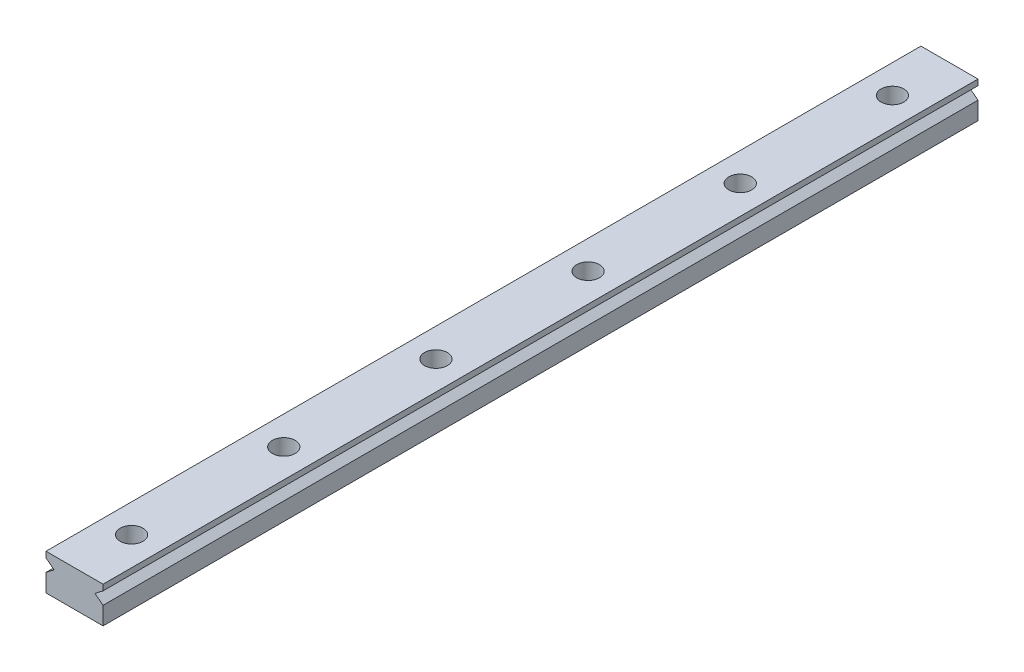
ISO-10303-21;
HEADER;
FILE_DESCRIPTION(('STEP AP214'),'2;1');
FILE_NAME('part.step','',(''),(''),'','','');
FILE_SCHEMA(('AUTOMOTIVE_DESIGN { 1 0 10303 214 1 1 1 1 }'));
ENDSEC;
DATA;
#1=APPLICATION_CONTEXT('core data for automotive mechanical design processes');
#2=APPLICATION_PROTOCOL_DEFINITION('international standard','automotive_design',2000,#1);
#3=PRODUCT_CONTEXT('',#1,'mechanical');
#4=PRODUCT('Part','Part','',(#3));
#5=PRODUCT_RELATED_PRODUCT_CATEGORY('part','',(#4));
#6=PRODUCT_DEFINITION_FORMATION('','',#4);
#7=PRODUCT_DEFINITION_CONTEXT('part definition',#1,'design');
#8=PRODUCT_DEFINITION('design','',#6,#7);
#9=PRODUCT_DEFINITION_SHAPE('','',#8);
#10=(LENGTH_UNIT() NAMED_UNIT(*) SI_UNIT(.MILLI.,.METRE.));
#11=(NAMED_UNIT(*) PLANE_ANGLE_UNIT() SI_UNIT($,.RADIAN.));
#12=(NAMED_UNIT(*) SI_UNIT($,.STERADIAN.) SOLID_ANGLE_UNIT());
#13=UNCERTAINTY_MEASURE_WITH_UNIT(LENGTH_MEASURE(1.E-05),#10,'distance_accuracy_value','');
#14=(GEOMETRIC_REPRESENTATION_CONTEXT(3) GLOBAL_UNCERTAINTY_ASSIGNED_CONTEXT((#13)) GLOBAL_UNIT_ASSIGNED_CONTEXT((#10,
#11,#12)) REPRESENTATION_CONTEXT('',''));
#15=CARTESIAN_POINT('',(0.,0.,0.));
#16=DIRECTION('',(0.,0.,1.));
#17=DIRECTION('',(1.,0.,0.));
#18=AXIS2_PLACEMENT_3D('',#15,#16,#17);
#19=CARTESIAN_POINT('',(-7.5,9.5,-230.));
#20=DIRECTION('',(0.,1.,0.));
#21=DIRECTION('',(0.,0.,1.));
#22=AXIS2_PLACEMENT_3D('',#19,#20,#21);
#23=PLANE('',#22);
#24=CARTESIAN_POINT('',(0.,9.5,-55.));
#25=DIRECTION('',(0.,1.,0.));
#26=DIRECTION('',(0.,0.,1.));
#27=AXIS2_PLACEMENT_3D('',#24,#25,#26);
#28=CIRCLE('',#27,3.);
#29=CARTESIAN_POINT('',(0.,9.5,-52.));
#30=VERTEX_POINT('',#29);
#31=EDGE_CURVE('E299',#30,#30,#28,.T.);
#32=ORIENTED_EDGE('',*,*,#31,.F.);
#33=EDGE_LOOP('',(#32));
#34=FACE_BOUND('',#33,.T.);
#35=CARTESIAN_POINT('',(0.,9.5,-135.));
#36=DIRECTION('',(0.,1.,0.));
#37=DIRECTION('',(0.,0.,1.));
#38=AXIS2_PLACEMENT_3D('',#35,#36,#37);
#39=CIRCLE('',#38,3.);
#40=CARTESIAN_POINT('',(0.,9.5,-132.));
#41=VERTEX_POINT('',#40);
#42=EDGE_CURVE('E275',#41,#41,#39,.T.);
#43=ORIENTED_EDGE('',*,*,#42,.F.);
#44=EDGE_LOOP('',(#43));
#45=FACE_BOUND('',#44,.T.);
#46=CARTESIAN_POINT('',(0.,9.5,-215.));
#47=DIRECTION('',(0.,1.,0.));
#48=DIRECTION('',(0.,0.,1.));
#49=AXIS2_PLACEMENT_3D('',#46,#47,#48);
#50=CIRCLE('',#49,3.);
#51=CARTESIAN_POINT('',(0.,9.5,-212.));
#52=VERTEX_POINT('',#51);
#53=EDGE_CURVE('E149',#52,#52,#50,.T.);
#54=ORIENTED_EDGE('',*,*,#53,.F.);
#55=EDGE_LOOP('',(#54));
#56=FACE_BOUND('',#55,.T.);
#57=DIRECTION('',(-1.,0.,0.));
#58=VECTOR('',#57,1.);
#59=CARTESIAN_POINT('',(-7.5,9.5,0.));
#60=LINE('',#59,#58);
#61=CARTESIAN_POINT('',(7.5,9.5,0.));
#62=VERTEX_POINT('',#61);
#63=CARTESIAN_POINT('',(-7.5,9.5,0.));
#64=VERTEX_POINT('',#63);
#65=EDGE_CURVE('E164',#62,#64,#60,.T.);
#66=ORIENTED_EDGE('',*,*,#65,.F.);
#67=DIRECTION('',(0.,0.,1.));
#68=VECTOR('',#67,1.);
#69=CARTESIAN_POINT('',(7.5,9.5,-230.));
#70=LINE('',#69,#68);
#71=CARTESIAN_POINT('',(7.5,9.5,-230.));
#72=VERTEX_POINT('',#71);
#73=EDGE_CURVE('E176',#72,#62,#70,.T.);
#74=ORIENTED_EDGE('',*,*,#73,.F.);
#75=DIRECTION('',(-1.,0.,0.));
#76=VECTOR('',#75,1.);
#77=CARTESIAN_POINT('',(-7.5,9.5,-230.));
#78=LINE('',#77,#76);
#79=CARTESIAN_POINT('',(-7.5,9.5,-230.));
#80=VERTEX_POINT('',#79);
#81=EDGE_CURVE('E138',#72,#80,#78,.T.);
#82=ORIENTED_EDGE('',*,*,#81,.T.);
#83=DIRECTION('',(0.,0.,1.));
#84=VECTOR('',#83,1.);
#85=CARTESIAN_POINT('',(-7.5,9.5,-230.));
#86=LINE('',#85,#84);
#87=EDGE_CURVE('E127',#80,#64,#86,.T.);
#88=ORIENTED_EDGE('',*,*,#87,.T.);
#89=EDGE_LOOP('',(#66,#74,#82,#88));
#90=FACE_BOUND('',#89,.T.);
#91=CARTESIAN_POINT('',(0.,9.5,-175.));
#92=DIRECTION('',(0.,1.,0.));
#93=DIRECTION('',(0.,0.,1.));
#94=AXIS2_PLACEMENT_3D('',#91,#92,#93);
#95=CIRCLE('',#94,3.);
#96=CARTESIAN_POINT('',(0.,9.5,-172.));
#97=VERTEX_POINT('',#96);
#98=EDGE_CURVE('E263',#97,#97,#95,.T.);
#99=ORIENTED_EDGE('',*,*,#98,.F.);
#100=EDGE_LOOP('',(#99));
#101=FACE_BOUND('',#100,.T.);
#102=CARTESIAN_POINT('',(0.,9.5,-95.));
#103=DIRECTION('',(0.,1.,0.));
#104=DIRECTION('',(0.,0.,1.));
#105=AXIS2_PLACEMENT_3D('',#102,#103,#104);
#106=CIRCLE('',#105,3.);
#107=CARTESIAN_POINT('',(0.,9.5,-92.));
#108=VERTEX_POINT('',#107);
#109=EDGE_CURVE('E287',#108,#108,#106,.T.);
#110=ORIENTED_EDGE('',*,*,#109,.F.);
#111=EDGE_LOOP('',(#110));
#112=FACE_BOUND('',#111,.T.);
#113=CARTESIAN_POINT('',(0.,9.5,-15.));
#114=DIRECTION('',(0.,1.,0.));
#115=DIRECTION('',(0.,0.,1.));
#116=AXIS2_PLACEMENT_3D('',#113,#114,#115);
#117=CIRCLE('',#116,3.);
#118=CARTESIAN_POINT('',(0.,9.5,-12.));
#119=VERTEX_POINT('',#118);
#120=EDGE_CURVE('E311',#119,#119,#117,.T.);
#121=ORIENTED_EDGE('',*,*,#120,.F.);
#122=EDGE_LOOP('',(#121));
#123=FACE_BOUND('',#122,.T.);
#124=ADVANCED_FACE('F35',(#34,#45,#56,#90,#101,#112,#123),#23,.T.);
#125=CARTESIAN_POINT('',(-7.5,0.,-230.));
#126=DIRECTION('',(0.,-1.,0.));
#127=DIRECTION('',(0.,0.,-1.));
#128=AXIS2_PLACEMENT_3D('',#125,#126,#127);
#129=PLANE('',#128);
#130=CARTESIAN_POINT('',(0.,0.,-55.));
#131=DIRECTION('',(0.,1.,0.));
#132=DIRECTION('',(0.,0.,1.));
#133=AXIS2_PLACEMENT_3D('',#130,#131,#132);
#134=CIRCLE('',#133,1.75);
#135=CARTESIAN_POINT('',(0.,0.,-53.25));
#136=VERTEX_POINT('',#135);
#137=EDGE_CURVE('E308',#136,#136,#134,.T.);
#138=ORIENTED_EDGE('',*,*,#137,.T.);
#139=EDGE_LOOP('',(#138));
#140=FACE_BOUND('',#139,.T.);
#141=CARTESIAN_POINT('',(0.,0.,-135.));
#142=DIRECTION('',(0.,1.,0.));
#143=DIRECTION('',(0.,0.,1.));
#144=AXIS2_PLACEMENT_3D('',#141,#142,#143);
#145=CIRCLE('',#144,1.75);
#146=CARTESIAN_POINT('',(0.,0.,-133.25));
#147=VERTEX_POINT('',#146);
#148=EDGE_CURVE('E284',#147,#147,#145,.T.);
#149=ORIENTED_EDGE('',*,*,#148,.T.);
#150=EDGE_LOOP('',(#149));
#151=FACE_BOUND('',#150,.T.);
#152=CARTESIAN_POINT('',(0.,0.,-215.));
#153=DIRECTION('',(0.,1.,0.));
#154=DIRECTION('',(0.,0.,1.));
#155=AXIS2_PLACEMENT_3D('',#152,#153,#154);
#156=CIRCLE('',#155,1.75);
#157=CARTESIAN_POINT('',(0.,0.,-213.25));
#158=VERTEX_POINT('',#157);
#159=EDGE_CURVE('E260',#158,#158,#156,.T.);
#160=ORIENTED_EDGE('',*,*,#159,.T.);
#161=EDGE_LOOP('',(#160));
#162=FACE_BOUND('',#161,.T.);
#163=DIRECTION('',(1.,0.,0.));
#164=VECTOR('',#163,1.);
#165=CARTESIAN_POINT('',(-7.5,0.,0.));
#166=LINE('',#165,#164);
#167=CARTESIAN_POINT('',(-7.5,0.,0.));
#168=VERTEX_POINT('',#167);
#169=CARTESIAN_POINT('',(7.5,0.,0.));
#170=VERTEX_POINT('',#169);
#171=EDGE_CURVE('E148',#168,#170,#166,.T.);
#172=ORIENTED_EDGE('',*,*,#171,.F.);
#173=DIRECTION('',(0.,0.,1.));
#174=VECTOR('',#173,1.);
#175=CARTESIAN_POINT('',(-7.5,0.,-230.));
#176=LINE('',#175,#174);
#177=CARTESIAN_POINT('',(-7.5,0.,-230.));
#178=VERTEX_POINT('',#177);
#179=EDGE_CURVE('E39',#178,#168,#176,.T.);
#180=ORIENTED_EDGE('',*,*,#179,.F.);
#181=DIRECTION('',(1.,0.,0.));
#182=VECTOR('',#181,1.);
#183=CARTESIAN_POINT('',(-7.5,0.,-230.));
#184=LINE('',#183,#182);
#185=CARTESIAN_POINT('',(7.5,0.,-230.));
#186=VERTEX_POINT('',#185);
#187=EDGE_CURVE('E249',#178,#186,#184,.T.);
#188=ORIENTED_EDGE('',*,*,#187,.T.);
#189=DIRECTION('',(0.,0.,1.));
#190=VECTOR('',#189,1.);
#191=CARTESIAN_POINT('',(7.5,0.,-230.));
#192=LINE('',#191,#190);
#193=EDGE_CURVE('E183',#186,#170,#192,.T.);
#194=ORIENTED_EDGE('',*,*,#193,.T.);
#195=EDGE_LOOP('',(#172,#180,#188,#194));
#196=FACE_BOUND('',#195,.T.);
#197=CARTESIAN_POINT('',(0.,0.,-175.));
#198=DIRECTION('',(0.,1.,0.));
#199=DIRECTION('',(0.,0.,1.));
#200=AXIS2_PLACEMENT_3D('',#197,#198,#199);
#201=CIRCLE('',#200,1.75);
#202=CARTESIAN_POINT('',(0.,0.,-173.25));
#203=VERTEX_POINT('',#202);
#204=EDGE_CURVE('E272',#203,#203,#201,.T.);
#205=ORIENTED_EDGE('',*,*,#204,.T.);
#206=EDGE_LOOP('',(#205));
#207=FACE_BOUND('',#206,.T.);
#208=CARTESIAN_POINT('',(0.,0.,-95.));
#209=DIRECTION('',(0.,1.,0.));
#210=DIRECTION('',(0.,0.,1.));
#211=AXIS2_PLACEMENT_3D('',#208,#209,#210);
#212=CIRCLE('',#211,1.75);
#213=CARTESIAN_POINT('',(0.,0.,-93.25));
#214=VERTEX_POINT('',#213);
#215=EDGE_CURVE('E296',#214,#214,#212,.T.);
#216=ORIENTED_EDGE('',*,*,#215,.T.);
#217=EDGE_LOOP('',(#216));
#218=FACE_BOUND('',#217,.T.);
#219=CARTESIAN_POINT('',(0.,0.,-15.));
#220=DIRECTION('',(0.,1.,0.));
#221=DIRECTION('',(0.,0.,1.));
#222=AXIS2_PLACEMENT_3D('',#219,#220,#221);
#223=CIRCLE('',#222,1.75);
#224=CARTESIAN_POINT('',(0.,0.,-13.25));
#225=VERTEX_POINT('',#224);
#226=EDGE_CURVE('E320',#225,#225,#223,.T.);
#227=ORIENTED_EDGE('',*,*,#226,.T.);
#228=EDGE_LOOP('',(#227));
#229=FACE_BOUND('',#228,.T.);
#230=ADVANCED_FACE('F185',(#140,#151,#162,#196,#207,#218,#229),#129,.T.);
#231=CARTESIAN_POINT('',(-7.5,0.,-230.));
#232=DIRECTION('',(-1.,0.,0.));
#233=DIRECTION('',(0.,0.,1.));
#234=AXIS2_PLACEMENT_3D('',#231,#232,#233);
#235=PLANE('',#234);
#236=DIRECTION('',(0.,-1.,0.));
#237=VECTOR('',#236,1.);
#238=CARTESIAN_POINT('',(-7.5,0.,0.));
#239=LINE('',#238,#237);
#240=CARTESIAN_POINT('',(-7.5,4.68906121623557,0.));
#241=VERTEX_POINT('',#240);
#242=EDGE_CURVE('E145',#241,#168,#239,.T.);
#243=ORIENTED_EDGE('',*,*,#242,.F.);
#244=DIRECTION('',(0.,0.,1.));
#245=VECTOR('',#244,1.);
#246=CARTESIAN_POINT('',(-7.5,4.68906121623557,-230.));
#247=LINE('',#246,#245);
#248=CARTESIAN_POINT('',(-7.5,4.68906121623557,-230.));
#249=VERTEX_POINT('',#248);
#250=EDGE_CURVE('E11',#249,#241,#247,.T.);
#251=ORIENTED_EDGE('',*,*,#250,.F.);
#252=DIRECTION('',(0.,-1.,0.));
#253=VECTOR('',#252,1.);
#254=CARTESIAN_POINT('',(-7.5,0.,-230.));
#255=LINE('',#254,#253);
#256=EDGE_CURVE('E172',#249,#178,#255,.T.);
#257=ORIENTED_EDGE('',*,*,#256,.T.);
#258=ORIENTED_EDGE('',*,*,#179,.T.);
#259=EDGE_LOOP('',(#243,#251,#257,#258));
#260=FACE_BOUND('',#259,.T.);
#261=ADVANCED_FACE('F37',(#260),#235,.T.);
#262=CARTESIAN_POINT('',(-5.35714285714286,6.33333333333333,-230.));
#263=DIRECTION('',(-0.608761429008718,0.793353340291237,0.));
#264=DIRECTION('',(-0.793353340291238,-0.608761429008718,0.));
#265=AXIS2_PLACEMENT_3D('',#262,#263,#264);
#266=PLANE('',#265);
#267=DIRECTION('',(-0.793353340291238,-0.608761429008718,0.));
#268=VECTOR('',#267,1.);
#269=CARTESIAN_POINT('',(-5.35714285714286,6.33333333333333,0.));
#270=LINE('',#269,#268);
#271=CARTESIAN_POINT('',(-5.35714285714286,6.33333333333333,0.));
#272=VERTEX_POINT('',#271);
#273=EDGE_CURVE('E170',#272,#241,#270,.T.);
#274=ORIENTED_EDGE('',*,*,#273,.F.);
#275=DIRECTION('',(0.,0.,1.));
#276=VECTOR('',#275,1.);
#277=CARTESIAN_POINT('',(-5.35714285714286,6.33333333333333,-230.));
#278=LINE('',#277,#276);
#279=CARTESIAN_POINT('',(-5.35714285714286,6.33333333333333,-230.));
#280=VERTEX_POINT('',#279);
#281=EDGE_CURVE('E45',#280,#272,#278,.T.);
#282=ORIENTED_EDGE('',*,*,#281,.F.);
#283=DIRECTION('',(-0.793353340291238,-0.608761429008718,0.));
#284=VECTOR('',#283,1.);
#285=CARTESIAN_POINT('',(-5.35714285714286,6.33333333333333,-230.));
#286=LINE('',#285,#284);
#287=EDGE_CURVE('E135',#280,#249,#286,.T.);
#288=ORIENTED_EDGE('',*,*,#287,.T.);
#289=ORIENTED_EDGE('',*,*,#250,.T.);
#290=EDGE_LOOP('',(#274,#282,#288,#289));
#291=FACE_BOUND('',#290,.T.);
#292=ADVANCED_FACE('F189',(#291),#266,.T.);
#293=CARTESIAN_POINT('',(-7.5,7.97760545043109,-230.));
#294=DIRECTION('',(-0.608761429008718,-0.793353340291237,0.));
#295=DIRECTION('',(0.793353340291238,-0.608761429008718,0.));
#296=AXIS2_PLACEMENT_3D('',#293,#294,#295);
#297=PLANE('',#296);
#298=DIRECTION('',(0.793353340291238,-0.608761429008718,0.));
#299=VECTOR('',#298,1.);
#300=CARTESIAN_POINT('',(-7.5,7.97760545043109,0.));
#301=LINE('',#300,#299);
#302=CARTESIAN_POINT('',(-7.5,7.97760545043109,0.));
#303=VERTEX_POINT('',#302);
#304=EDGE_CURVE('E122',#303,#272,#301,.T.);
#305=ORIENTED_EDGE('',*,*,#304,.F.);
#306=DIRECTION('',(0.,0.,1.));
#307=VECTOR('',#306,1.);
#308=CARTESIAN_POINT('',(-7.5,7.97760545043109,-230.));
#309=LINE('',#308,#307);
#310=CARTESIAN_POINT('',(-7.5,7.97760545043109,-230.));
#311=VERTEX_POINT('',#310);
#312=EDGE_CURVE('E117',#311,#303,#309,.T.);
#313=ORIENTED_EDGE('',*,*,#312,.F.);
#314=DIRECTION('',(0.793353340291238,-0.608761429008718,0.));
#315=VECTOR('',#314,1.);
#316=CARTESIAN_POINT('',(-7.5,7.97760545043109,-230.));
#317=LINE('',#316,#315);
#318=EDGE_CURVE('E120',#311,#280,#317,.T.);
#319=ORIENTED_EDGE('',*,*,#318,.T.);
#320=ORIENTED_EDGE('',*,*,#281,.T.);
#321=EDGE_LOOP('',(#305,#313,#319,#320));
#322=FACE_BOUND('',#321,.T.);
#323=ADVANCED_FACE('F119',(#322),#297,.T.);
#324=CARTESIAN_POINT('',(-7.5,7.97760545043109,-230.));
#325=DIRECTION('',(-1.,0.,0.));
#326=DIRECTION('',(0.,0.,1.));
#327=AXIS2_PLACEMENT_3D('',#324,#325,#326);
#328=PLANE('',#327);
#329=DIRECTION('',(0.,-1.,0.));
#330=VECTOR('',#329,1.);
#331=CARTESIAN_POINT('',(-7.5,7.97760545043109,0.));
#332=LINE('',#331,#330);
#333=EDGE_CURVE('E167',#64,#303,#332,.T.);
#334=ORIENTED_EDGE('',*,*,#333,.F.);
#335=ORIENTED_EDGE('',*,*,#87,.F.);
#336=DIRECTION('',(0.,-1.,0.));
#337=VECTOR('',#336,1.);
#338=CARTESIAN_POINT('',(-7.5,7.97760545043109,-230.));
#339=LINE('',#338,#337);
#340=EDGE_CURVE('E133',#80,#311,#339,.T.);
#341=ORIENTED_EDGE('',*,*,#340,.T.);
#342=ORIENTED_EDGE('',*,*,#312,.T.);
#343=EDGE_LOOP('',(#334,#335,#341,#342));
#344=FACE_BOUND('',#343,.T.);
#345=ADVANCED_FACE('F137',(#344),#328,.T.);
#346=CARTESIAN_POINT('',(7.5,7.97760545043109,-230.));
#347=DIRECTION('',(1.,0.,0.));
#348=DIRECTION('',(0.,0.,-1.));
#349=AXIS2_PLACEMENT_3D('',#346,#347,#348);
#350=PLANE('',#349);
#351=DIRECTION('',(0.,1.,0.));
#352=VECTOR('',#351,1.);
#353=CARTESIAN_POINT('',(7.5,7.97760545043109,0.));
#354=LINE('',#353,#352);
#355=CARTESIAN_POINT('',(7.5,7.97760545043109,0.));
#356=VERTEX_POINT('',#355);
#357=EDGE_CURVE('E161',#356,#62,#354,.T.);
#358=ORIENTED_EDGE('',*,*,#357,.F.);
#359=DIRECTION('',(0.,0.,1.));
#360=VECTOR('',#359,1.);
#361=CARTESIAN_POINT('',(7.5,7.97760545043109,-230.));
#362=LINE('',#361,#360);
#363=CARTESIAN_POINT('',(7.5,7.97760545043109,-230.));
#364=VERTEX_POINT('',#363);
#365=EDGE_CURVE('E178',#364,#356,#362,.T.);
#366=ORIENTED_EDGE('',*,*,#365,.F.);
#367=DIRECTION('',(0.,1.,0.));
#368=VECTOR('',#367,1.);
#369=CARTESIAN_POINT('',(7.5,7.97760545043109,-230.));
#370=LINE('',#369,#368);
#371=EDGE_CURVE('E140',#364,#72,#370,.T.);
#372=ORIENTED_EDGE('',*,*,#371,.T.);
#373=ORIENTED_EDGE('',*,*,#73,.T.);
#374=EDGE_LOOP('',(#358,#366,#372,#373));
#375=FACE_BOUND('',#374,.T.);
#376=ADVANCED_FACE('F209',(#375),#350,.T.);
#377=CARTESIAN_POINT('',(7.5,7.97760545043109,-230.));
#378=DIRECTION('',(0.608761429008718,-0.793353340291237,0.));
#379=DIRECTION('',(0.793353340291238,0.608761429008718,0.));
#380=AXIS2_PLACEMENT_3D('',#377,#378,#379);
#381=PLANE('',#380);
#382=DIRECTION('',(0.793353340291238,0.608761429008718,0.));
#383=VECTOR('',#382,1.);
#384=CARTESIAN_POINT('',(7.5,7.97760545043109,0.));
#385=LINE('',#384,#383);
#386=CARTESIAN_POINT('',(5.35714285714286,6.33333333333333,0.));
#387=VERTEX_POINT('',#386);
#388=EDGE_CURVE('E158',#387,#356,#385,.T.);
#389=ORIENTED_EDGE('',*,*,#388,.F.);
#390=DIRECTION('',(0.,0.,1.));
#391=VECTOR('',#390,1.);
#392=CARTESIAN_POINT('',(5.35714285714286,6.33333333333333,-230.));
#393=LINE('',#392,#391);
#394=CARTESIAN_POINT('',(5.35714285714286,6.33333333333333,-230.));
#395=VERTEX_POINT('',#394);
#396=EDGE_CURVE('E180',#395,#387,#393,.T.);
#397=ORIENTED_EDGE('',*,*,#396,.F.);
#398=DIRECTION('',(0.793353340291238,0.608761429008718,0.));
#399=VECTOR('',#398,1.);
#400=CARTESIAN_POINT('',(7.5,7.97760545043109,-230.));
#401=LINE('',#400,#399);
#402=EDGE_CURVE('E238',#395,#364,#401,.T.);
#403=ORIENTED_EDGE('',*,*,#402,.T.);
#404=ORIENTED_EDGE('',*,*,#365,.T.);
#405=EDGE_LOOP('',(#389,#397,#403,#404));
#406=FACE_BOUND('',#405,.T.);
#407=ADVANCED_FACE('F212',(#406),#381,.T.);
#408=CARTESIAN_POINT('',(5.35714285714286,6.33333333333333,-230.));
#409=DIRECTION('',(0.608761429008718,0.793353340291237,0.));
#410=DIRECTION('',(-0.793353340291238,0.608761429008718,0.));
#411=AXIS2_PLACEMENT_3D('',#408,#409,#410);
#412=PLANE('',#411);
#413=DIRECTION('',(-0.793353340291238,0.608761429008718,0.));
#414=VECTOR('',#413,1.);
#415=CARTESIAN_POINT('',(5.35714285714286,6.33333333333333,0.));
#416=LINE('',#415,#414);
#417=CARTESIAN_POINT('',(7.5,4.68906121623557,0.));
#418=VERTEX_POINT('',#417);
#419=EDGE_CURVE('E155',#418,#387,#416,.T.);
#420=ORIENTED_EDGE('',*,*,#419,.F.);
#421=DIRECTION('',(0.,0.,1.));
#422=VECTOR('',#421,1.);
#423=CARTESIAN_POINT('',(7.5,4.68906121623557,-230.));
#424=LINE('',#423,#422);
#425=CARTESIAN_POINT('',(7.5,4.68906121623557,-230.));
#426=VERTEX_POINT('',#425);
#427=EDGE_CURVE('E182',#426,#418,#424,.T.);
#428=ORIENTED_EDGE('',*,*,#427,.F.);
#429=DIRECTION('',(-0.793353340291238,0.608761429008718,0.));
#430=VECTOR('',#429,1.);
#431=CARTESIAN_POINT('',(5.35714285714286,6.33333333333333,-230.));
#432=LINE('',#431,#430);
#433=EDGE_CURVE('E234',#426,#395,#432,.T.);
#434=ORIENTED_EDGE('',*,*,#433,.T.);
#435=ORIENTED_EDGE('',*,*,#396,.T.);
#436=EDGE_LOOP('',(#420,#428,#434,#435));
#437=FACE_BOUND('',#436,.T.);
#438=ADVANCED_FACE('F216',(#437),#412,.T.);
#439=CARTESIAN_POINT('',(7.5,0.,-230.));
#440=DIRECTION('',(1.,0.,0.));
#441=DIRECTION('',(0.,0.,-1.));
#442=AXIS2_PLACEMENT_3D('',#439,#440,#441);
#443=PLANE('',#442);
#444=DIRECTION('',(0.,1.,0.));
#445=VECTOR('',#444,1.);
#446=CARTESIAN_POINT('',(7.5,0.,0.));
#447=LINE('',#446,#445);
#448=EDGE_CURVE('E152',#170,#418,#447,.T.);
#449=ORIENTED_EDGE('',*,*,#448,.F.);
#450=ORIENTED_EDGE('',*,*,#193,.F.);
#451=DIRECTION('',(0.,1.,0.));
#452=VECTOR('',#451,1.);
#453=CARTESIAN_POINT('',(7.5,0.,-230.));
#454=LINE('',#453,#452);
#455=EDGE_CURVE('E247',#186,#426,#454,.T.);
#456=ORIENTED_EDGE('',*,*,#455,.T.);
#457=ORIENTED_EDGE('',*,*,#427,.T.);
#458=EDGE_LOOP('',(#449,#450,#456,#457));
#459=FACE_BOUND('',#458,.T.);
#460=ADVANCED_FACE('F220',(#459),#443,.T.);
#461=CARTESIAN_POINT('',(-7.5,9.5,-230.));
#462=DIRECTION('',(0.,0.,-1.));
#463=DIRECTION('',(-1.,0.,0.));
#464=AXIS2_PLACEMENT_3D('',#461,#462,#463);
#465=PLANE('',#464);
#466=ORIENTED_EDGE('',*,*,#256,.F.);
#467=ORIENTED_EDGE('',*,*,#287,.F.);
#468=ORIENTED_EDGE('',*,*,#318,.F.);
#469=ORIENTED_EDGE('',*,*,#340,.F.);
#470=ORIENTED_EDGE('',*,*,#81,.F.);
#471=ORIENTED_EDGE('',*,*,#371,.F.);
#472=ORIENTED_EDGE('',*,*,#402,.F.);
#473=ORIENTED_EDGE('',*,*,#433,.F.);
#474=ORIENTED_EDGE('',*,*,#455,.F.);
#475=ORIENTED_EDGE('',*,*,#187,.F.);
#476=EDGE_LOOP('',(#466,#467,#468,#469,#470,#471,#472,#473,#474,#475));
#477=FACE_BOUND('',#476,.T.);
#478=ADVANCED_FACE('F131',(#477),#465,.T.);
#479=CARTESIAN_POINT('',(-7.5,9.5,0.));
#480=DIRECTION('',(0.,0.,-1.));
#481=DIRECTION('',(-1.,0.,0.));
#482=AXIS2_PLACEMENT_3D('',#479,#480,#481);
#483=PLANE('',#482);
#484=ORIENTED_EDGE('',*,*,#242,.T.);
#485=ORIENTED_EDGE('',*,*,#171,.T.);
#486=ORIENTED_EDGE('',*,*,#448,.T.);
#487=ORIENTED_EDGE('',*,*,#419,.T.);
#488=ORIENTED_EDGE('',*,*,#388,.T.);
#489=ORIENTED_EDGE('',*,*,#357,.T.);
#490=ORIENTED_EDGE('',*,*,#65,.T.);
#491=ORIENTED_EDGE('',*,*,#333,.T.);
#492=ORIENTED_EDGE('',*,*,#304,.T.);
#493=ORIENTED_EDGE('',*,*,#273,.T.);
#494=EDGE_LOOP('',(#484,#485,#486,#487,#488,#489,#490,#491,#492,#493));
#495=FACE_BOUND('',#494,.T.);
#496=ADVANCED_FACE('F188',(#495),#483,.F.);
#497=CARTESIAN_POINT('',(0.,8.90490543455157,-215.));
#498=DIRECTION('',(0.,1.,0.));
#499=DIRECTION('',(0.,0.,1.));
#500=AXIS2_PLACEMENT_3D('',#497,#498,#499);
#501=CYLINDRICAL_SURFACE('',#500,3.);
#502=ORIENTED_EDGE('',*,*,#53,.T.);
#503=EDGE_LOOP('',(#502));
#504=FACE_BOUND('',#503,.T.);
#505=CARTESIAN_POINT('',(0.,5.,-215.));
#506=DIRECTION('',(0.,1.,0.));
#507=DIRECTION('',(0.,0.,1.));
#508=AXIS2_PLACEMENT_3D('',#505,#506,#507);
#509=CIRCLE('',#508,3.);
#510=CARTESIAN_POINT('',(0.,5.,-212.));
#511=VERTEX_POINT('',#510);
#512=EDGE_CURVE('E254',#511,#511,#509,.T.);
#513=ORIENTED_EDGE('',*,*,#512,.F.);
#514=EDGE_LOOP('',(#513));
#515=FACE_BOUND('',#514,.T.);
#516=ADVANCED_FACE('F395',(#504,#515),#501,.F.);
#517=CARTESIAN_POINT('',(0.,5.,-218.));
#518=DIRECTION('',(0.,1.,0.));
#519=DIRECTION('',(0.,0.,1.));
#520=AXIS2_PLACEMENT_3D('',#517,#518,#519);
#521=PLANE('',#520);
#522=ORIENTED_EDGE('',*,*,#512,.T.);
#523=EDGE_LOOP('',(#522));
#524=FACE_BOUND('',#523,.T.);
#525=CARTESIAN_POINT('',(0.,5.,-215.));
#526=DIRECTION('',(0.,1.,0.));
#527=DIRECTION('',(0.,0.,1.));
#528=AXIS2_PLACEMENT_3D('',#525,#526,#527);
#529=CIRCLE('',#528,1.75);
#530=CARTESIAN_POINT('',(0.,5.,-213.25));
#531=VERTEX_POINT('',#530);
#532=EDGE_CURVE('E257',#531,#531,#529,.T.);
#533=ORIENTED_EDGE('',*,*,#532,.F.);
#534=EDGE_LOOP('',(#533));
#535=FACE_BOUND('',#534,.T.);
#536=ADVANCED_FACE('F391',(#524,#535),#521,.T.);
#537=CARTESIAN_POINT('',(0.,8.90490543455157,-215.));
#538=DIRECTION('',(0.,1.,0.));
#539=DIRECTION('',(0.,0.,1.));
#540=AXIS2_PLACEMENT_3D('',#537,#538,#539);
#541=CYLINDRICAL_SURFACE('',#540,1.75);
#542=ORIENTED_EDGE('',*,*,#532,.T.);
#543=EDGE_LOOP('',(#542));
#544=FACE_BOUND('',#543,.T.);
#545=ORIENTED_EDGE('',*,*,#159,.F.);
#546=EDGE_LOOP('',(#545));
#547=FACE_BOUND('',#546,.T.);
#548=ADVANCED_FACE('F387',(#544,#547),#541,.F.);
#549=CARTESIAN_POINT('',(0.,8.90490543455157,-175.));
#550=DIRECTION('',(0.,1.,0.));
#551=DIRECTION('',(0.,0.,1.));
#552=AXIS2_PLACEMENT_3D('',#549,#550,#551);
#553=CYLINDRICAL_SURFACE('',#552,3.);
#554=ORIENTED_EDGE('',*,*,#98,.T.);
#555=EDGE_LOOP('',(#554));
#556=FACE_BOUND('',#555,.T.);
#557=CARTESIAN_POINT('',(0.,5.,-175.));
#558=DIRECTION('',(0.,1.,0.));
#559=DIRECTION('',(0.,0.,1.));
#560=AXIS2_PLACEMENT_3D('',#557,#558,#559);
#561=CIRCLE('',#560,3.);
#562=CARTESIAN_POINT('',(0.,5.,-172.));
#563=VERTEX_POINT('',#562);
#564=EDGE_CURVE('E266',#563,#563,#561,.T.);
#565=ORIENTED_EDGE('',*,*,#564,.F.);
#566=EDGE_LOOP('',(#565));
#567=FACE_BOUND('',#566,.T.);
#568=ADVANCED_FACE('F383',(#556,#567),#553,.F.);
#569=CARTESIAN_POINT('',(0.,5.,-178.));
#570=DIRECTION('',(0.,1.,0.));
#571=DIRECTION('',(0.,0.,1.));
#572=AXIS2_PLACEMENT_3D('',#569,#570,#571);
#573=PLANE('',#572);
#574=ORIENTED_EDGE('',*,*,#564,.T.);
#575=EDGE_LOOP('',(#574));
#576=FACE_BOUND('',#575,.T.);
#577=CARTESIAN_POINT('',(0.,5.,-175.));
#578=DIRECTION('',(0.,1.,0.));
#579=DIRECTION('',(0.,0.,1.));
#580=AXIS2_PLACEMENT_3D('',#577,#578,#579);
#581=CIRCLE('',#580,1.75);
#582=CARTESIAN_POINT('',(0.,5.,-173.25));
#583=VERTEX_POINT('',#582);
#584=EDGE_CURVE('E269',#583,#583,#581,.T.);
#585=ORIENTED_EDGE('',*,*,#584,.F.);
#586=EDGE_LOOP('',(#585));
#587=FACE_BOUND('',#586,.T.);
#588=ADVANCED_FACE('F379',(#576,#587),#573,.T.);
#589=CARTESIAN_POINT('',(0.,8.90490543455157,-175.));
#590=DIRECTION('',(0.,1.,0.));
#591=DIRECTION('',(0.,0.,1.));
#592=AXIS2_PLACEMENT_3D('',#589,#590,#591);
#593=CYLINDRICAL_SURFACE('',#592,1.75);
#594=ORIENTED_EDGE('',*,*,#584,.T.);
#595=EDGE_LOOP('',(#594));
#596=FACE_BOUND('',#595,.T.);
#597=ORIENTED_EDGE('',*,*,#204,.F.);
#598=EDGE_LOOP('',(#597));
#599=FACE_BOUND('',#598,.T.);
#600=ADVANCED_FACE('F375',(#596,#599),#593,.F.);
#601=CARTESIAN_POINT('',(0.,8.90490543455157,-135.));
#602=DIRECTION('',(0.,1.,0.));
#603=DIRECTION('',(0.,0.,1.));
#604=AXIS2_PLACEMENT_3D('',#601,#602,#603);
#605=CYLINDRICAL_SURFACE('',#604,3.);
#606=ORIENTED_EDGE('',*,*,#42,.T.);
#607=EDGE_LOOP('',(#606));
#608=FACE_BOUND('',#607,.T.);
#609=CARTESIAN_POINT('',(0.,5.,-135.));
#610=DIRECTION('',(0.,1.,0.));
#611=DIRECTION('',(0.,0.,1.));
#612=AXIS2_PLACEMENT_3D('',#609,#610,#611);
#613=CIRCLE('',#612,3.);
#614=CARTESIAN_POINT('',(0.,5.,-132.));
#615=VERTEX_POINT('',#614);
#616=EDGE_CURVE('E278',#615,#615,#613,.T.);
#617=ORIENTED_EDGE('',*,*,#616,.F.);
#618=EDGE_LOOP('',(#617));
#619=FACE_BOUND('',#618,.T.);
#620=ADVANCED_FACE('F371',(#608,#619),#605,.F.);
#621=CARTESIAN_POINT('',(0.,5.,-138.));
#622=DIRECTION('',(0.,1.,0.));
#623=DIRECTION('',(0.,0.,1.));
#624=AXIS2_PLACEMENT_3D('',#621,#622,#623);
#625=PLANE('',#624);
#626=ORIENTED_EDGE('',*,*,#616,.T.);
#627=EDGE_LOOP('',(#626));
#628=FACE_BOUND('',#627,.T.);
#629=CARTESIAN_POINT('',(0.,5.,-135.));
#630=DIRECTION('',(0.,1.,0.));
#631=DIRECTION('',(0.,0.,1.));
#632=AXIS2_PLACEMENT_3D('',#629,#630,#631);
#633=CIRCLE('',#632,1.75);
#634=CARTESIAN_POINT('',(0.,5.,-133.25));
#635=VERTEX_POINT('',#634);
#636=EDGE_CURVE('E281',#635,#635,#633,.T.);
#637=ORIENTED_EDGE('',*,*,#636,.F.);
#638=EDGE_LOOP('',(#637));
#639=FACE_BOUND('',#638,.T.);
#640=ADVANCED_FACE('F367',(#628,#639),#625,.T.);
#641=CARTESIAN_POINT('',(0.,8.90490543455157,-135.));
#642=DIRECTION('',(0.,1.,0.));
#643=DIRECTION('',(0.,0.,1.));
#644=AXIS2_PLACEMENT_3D('',#641,#642,#643);
#645=CYLINDRICAL_SURFACE('',#644,1.75);
#646=ORIENTED_EDGE('',*,*,#636,.T.);
#647=EDGE_LOOP('',(#646));
#648=FACE_BOUND('',#647,.T.);
#649=ORIENTED_EDGE('',*,*,#148,.F.);
#650=EDGE_LOOP('',(#649));
#651=FACE_BOUND('',#650,.T.);
#652=ADVANCED_FACE('F363',(#648,#651),#645,.F.);
#653=CARTESIAN_POINT('',(0.,8.90490543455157,-95.));
#654=DIRECTION('',(0.,1.,0.));
#655=DIRECTION('',(0.,0.,1.));
#656=AXIS2_PLACEMENT_3D('',#653,#654,#655);
#657=CYLINDRICAL_SURFACE('',#656,3.);
#658=ORIENTED_EDGE('',*,*,#109,.T.);
#659=EDGE_LOOP('',(#658));
#660=FACE_BOUND('',#659,.T.);
#661=CARTESIAN_POINT('',(0.,5.,-95.));
#662=DIRECTION('',(0.,1.,0.));
#663=DIRECTION('',(0.,0.,1.));
#664=AXIS2_PLACEMENT_3D('',#661,#662,#663);
#665=CIRCLE('',#664,3.);
#666=CARTESIAN_POINT('',(0.,5.,-92.));
#667=VERTEX_POINT('',#666);
#668=EDGE_CURVE('E290',#667,#667,#665,.T.);
#669=ORIENTED_EDGE('',*,*,#668,.F.);
#670=EDGE_LOOP('',(#669));
#671=FACE_BOUND('',#670,.T.);
#672=ADVANCED_FACE('F359',(#660,#671),#657,.F.);
#673=CARTESIAN_POINT('',(0.,5.,-98.));
#674=DIRECTION('',(0.,1.,0.));
#675=DIRECTION('',(0.,0.,1.));
#676=AXIS2_PLACEMENT_3D('',#673,#674,#675);
#677=PLANE('',#676);
#678=ORIENTED_EDGE('',*,*,#668,.T.);
#679=EDGE_LOOP('',(#678));
#680=FACE_BOUND('',#679,.T.);
#681=CARTESIAN_POINT('',(0.,5.,-95.));
#682=DIRECTION('',(0.,1.,0.));
#683=DIRECTION('',(0.,0.,1.));
#684=AXIS2_PLACEMENT_3D('',#681,#682,#683);
#685=CIRCLE('',#684,1.75);
#686=CARTESIAN_POINT('',(0.,5.,-93.25));
#687=VERTEX_POINT('',#686);
#688=EDGE_CURVE('E293',#687,#687,#685,.T.);
#689=ORIENTED_EDGE('',*,*,#688,.F.);
#690=EDGE_LOOP('',(#689));
#691=FACE_BOUND('',#690,.T.);
#692=ADVANCED_FACE('F355',(#680,#691),#677,.T.);
#693=CARTESIAN_POINT('',(0.,8.90490543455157,-95.));
#694=DIRECTION('',(0.,1.,0.));
#695=DIRECTION('',(0.,0.,1.));
#696=AXIS2_PLACEMENT_3D('',#693,#694,#695);
#697=CYLINDRICAL_SURFACE('',#696,1.75);
#698=ORIENTED_EDGE('',*,*,#688,.T.);
#699=EDGE_LOOP('',(#698));
#700=FACE_BOUND('',#699,.T.);
#701=ORIENTED_EDGE('',*,*,#215,.F.);
#702=EDGE_LOOP('',(#701));
#703=FACE_BOUND('',#702,.T.);
#704=ADVANCED_FACE('F351',(#700,#703),#697,.F.);
#705=CARTESIAN_POINT('',(0.,8.90490543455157,-55.));
#706=DIRECTION('',(0.,1.,0.));
#707=DIRECTION('',(0.,0.,1.));
#708=AXIS2_PLACEMENT_3D('',#705,#706,#707);
#709=CYLINDRICAL_SURFACE('',#708,3.);
#710=ORIENTED_EDGE('',*,*,#31,.T.);
#711=EDGE_LOOP('',(#710));
#712=FACE_BOUND('',#711,.T.);
#713=CARTESIAN_POINT('',(0.,5.,-55.));
#714=DIRECTION('',(0.,1.,0.));
#715=DIRECTION('',(0.,0.,1.));
#716=AXIS2_PLACEMENT_3D('',#713,#714,#715);
#717=CIRCLE('',#716,3.);
#718=CARTESIAN_POINT('',(0.,5.,-52.));
#719=VERTEX_POINT('',#718);
#720=EDGE_CURVE('E302',#719,#719,#717,.T.);
#721=ORIENTED_EDGE('',*,*,#720,.F.);
#722=EDGE_LOOP('',(#721));
#723=FACE_BOUND('',#722,.T.);
#724=ADVANCED_FACE('F347',(#712,#723),#709,.F.);
#725=CARTESIAN_POINT('',(0.,5.,-58.));
#726=DIRECTION('',(0.,1.,0.));
#727=DIRECTION('',(0.,0.,1.));
#728=AXIS2_PLACEMENT_3D('',#725,#726,#727);
#729=PLANE('',#728);
#730=ORIENTED_EDGE('',*,*,#720,.T.);
#731=EDGE_LOOP('',(#730));
#732=FACE_BOUND('',#731,.T.);
#733=CARTESIAN_POINT('',(0.,5.,-55.));
#734=DIRECTION('',(0.,1.,0.));
#735=DIRECTION('',(0.,0.,1.));
#736=AXIS2_PLACEMENT_3D('',#733,#734,#735);
#737=CIRCLE('',#736,1.75);
#738=CARTESIAN_POINT('',(0.,5.,-53.25));
#739=VERTEX_POINT('',#738);
#740=EDGE_CURVE('E305',#739,#739,#737,.T.);
#741=ORIENTED_EDGE('',*,*,#740,.F.);
#742=EDGE_LOOP('',(#741));
#743=FACE_BOUND('',#742,.T.);
#744=ADVANCED_FACE('F343',(#732,#743),#729,.T.);
#745=CARTESIAN_POINT('',(0.,8.90490543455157,-55.));
#746=DIRECTION('',(0.,1.,0.));
#747=DIRECTION('',(0.,0.,1.));
#748=AXIS2_PLACEMENT_3D('',#745,#746,#747);
#749=CYLINDRICAL_SURFACE('',#748,1.75);
#750=ORIENTED_EDGE('',*,*,#740,.T.);
#751=EDGE_LOOP('',(#750));
#752=FACE_BOUND('',#751,.T.);
#753=ORIENTED_EDGE('',*,*,#137,.F.);
#754=EDGE_LOOP('',(#753));
#755=FACE_BOUND('',#754,.T.);
#756=ADVANCED_FACE('F339',(#752,#755),#749,.F.);
#757=CARTESIAN_POINT('',(0.,8.90490543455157,-15.));
#758=DIRECTION('',(0.,1.,0.));
#759=DIRECTION('',(0.,0.,1.));
#760=AXIS2_PLACEMENT_3D('',#757,#758,#759);
#761=CYLINDRICAL_SURFACE('',#760,3.);
#762=ORIENTED_EDGE('',*,*,#120,.T.);
#763=EDGE_LOOP('',(#762));
#764=FACE_BOUND('',#763,.T.);
#765=CARTESIAN_POINT('',(0.,5.,-15.));
#766=DIRECTION('',(0.,1.,0.));
#767=DIRECTION('',(0.,0.,1.));
#768=AXIS2_PLACEMENT_3D('',#765,#766,#767);
#769=CIRCLE('',#768,3.);
#770=CARTESIAN_POINT('',(0.,5.,-12.));
#771=VERTEX_POINT('',#770);
#772=EDGE_CURVE('E314',#771,#771,#769,.T.);
#773=ORIENTED_EDGE('',*,*,#772,.F.);
#774=EDGE_LOOP('',(#773));
#775=FACE_BOUND('',#774,.T.);
#776=ADVANCED_FACE('F333',(#764,#775),#761,.F.);
#777=CARTESIAN_POINT('',(0.,5.,-18.));
#778=DIRECTION('',(0.,1.,0.));
#779=DIRECTION('',(0.,0.,1.));
#780=AXIS2_PLACEMENT_3D('',#777,#778,#779);
#781=PLANE('',#780);
#782=ORIENTED_EDGE('',*,*,#772,.T.);
#783=EDGE_LOOP('',(#782));
#784=FACE_BOUND('',#783,.T.);
#785=CARTESIAN_POINT('',(0.,5.,-15.));
#786=DIRECTION('',(0.,1.,0.));
#787=DIRECTION('',(0.,0.,1.));
#788=AXIS2_PLACEMENT_3D('',#785,#786,#787);
#789=CIRCLE('',#788,1.75);
#790=CARTESIAN_POINT('',(0.,5.,-13.25));
#791=VERTEX_POINT('',#790);
#792=EDGE_CURVE('E317',#791,#791,#789,.T.);
#793=ORIENTED_EDGE('',*,*,#792,.F.);
#794=EDGE_LOOP('',(#793));
#795=FACE_BOUND('',#794,.T.);
#796=ADVANCED_FACE('F327',(#784,#795),#781,.T.);
#797=CARTESIAN_POINT('',(0.,8.90490543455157,-15.));
#798=DIRECTION('',(0.,1.,0.));
#799=DIRECTION('',(0.,0.,1.));
#800=AXIS2_PLACEMENT_3D('',#797,#798,#799);
#801=CYLINDRICAL_SURFACE('',#800,1.75);
#802=ORIENTED_EDGE('',*,*,#792,.T.);
#803=EDGE_LOOP('',(#802));
#804=FACE_BOUND('',#803,.T.);
#805=ORIENTED_EDGE('',*,*,#226,.F.);
#806=EDGE_LOOP('',(#805));
#807=FACE_BOUND('',#806,.T.);
#808=ADVANCED_FACE('F325',(#804,#807),#801,.F.);
#809=CLOSED_SHELL('',(#124,#230,#261,#292,#323,#345,#376,#407,#438,#460,#478,#496,#516,#536,
#548,#568,#588,#600,#620,#640,#652,#672,#692,#704,#724,#744,#756,#776,#796,#808));
#810=MANIFOLD_SOLID_BREP('B2',#809);
#811=ADVANCED_BREP_SHAPE_REPRESENTATION('',(#18,#810),#14);
#812=SHAPE_DEFINITION_REPRESENTATION(#9,#811);
ENDSEC;
END-ISO-10303-21;
